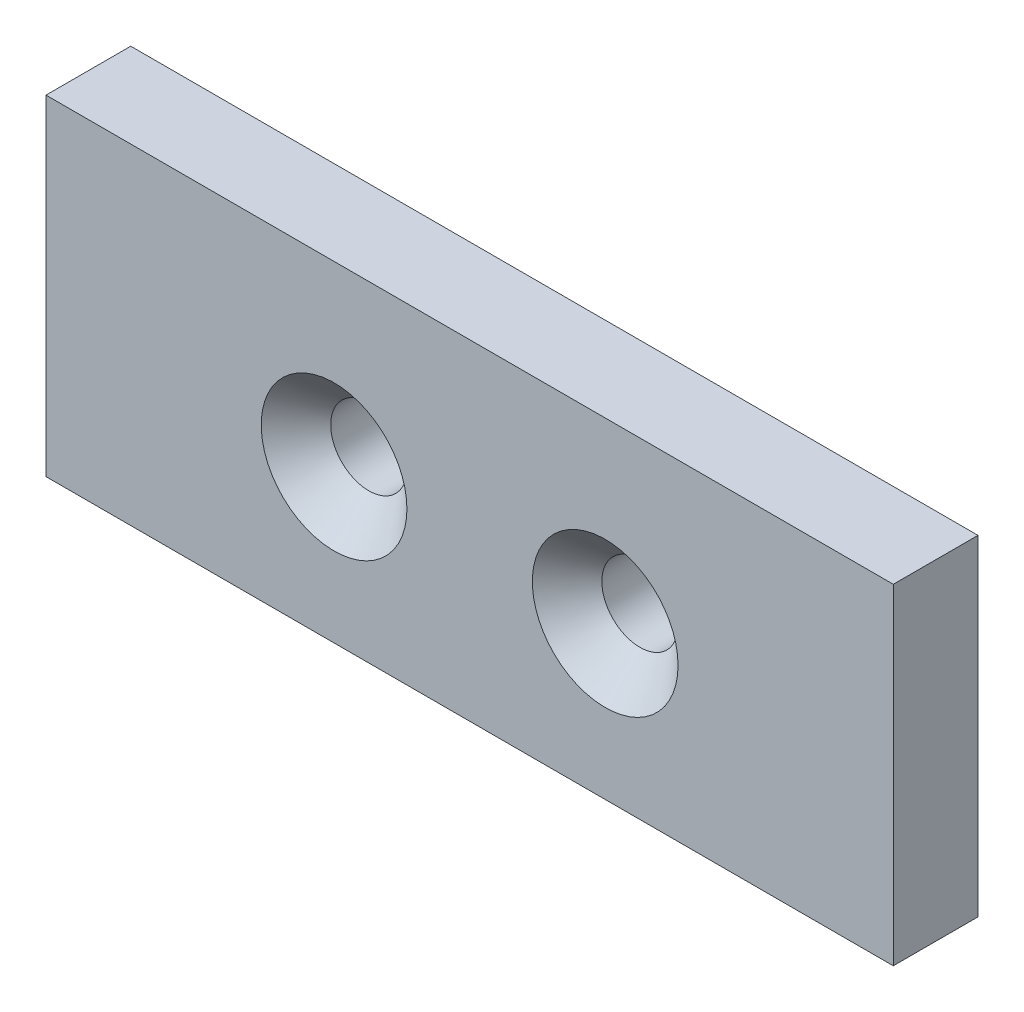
ISO-10303-21;
HEADER;
FILE_DESCRIPTION(('STEP AP214'),'2;1');
FILE_NAME('part.step','',(''),(''),'','','');
FILE_SCHEMA(('AUTOMOTIVE_DESIGN { 1 0 10303 214 1 1 1 1 }'));
ENDSEC;
DATA;
#1=APPLICATION_CONTEXT('core data for automotive mechanical design processes');
#2=APPLICATION_PROTOCOL_DEFINITION('international standard','automotive_design',2000,#1);
#3=PRODUCT_CONTEXT('',#1,'mechanical');
#4=PRODUCT('Part','Part','',(#3));
#5=PRODUCT_RELATED_PRODUCT_CATEGORY('part','',(#4));
#6=PRODUCT_DEFINITION_FORMATION('','',#4);
#7=PRODUCT_DEFINITION_CONTEXT('part definition',#1,'design');
#8=PRODUCT_DEFINITION('design','',#6,#7);
#9=PRODUCT_DEFINITION_SHAPE('','',#8);
#10=(LENGTH_UNIT() NAMED_UNIT(*) SI_UNIT(.MILLI.,.METRE.));
#11=(NAMED_UNIT(*) PLANE_ANGLE_UNIT() SI_UNIT($,.RADIAN.));
#12=(NAMED_UNIT(*) SI_UNIT($,.STERADIAN.) SOLID_ANGLE_UNIT());
#13=UNCERTAINTY_MEASURE_WITH_UNIT(LENGTH_MEASURE(1.E-05),#10,'distance_accuracy_value','');
#14=(GEOMETRIC_REPRESENTATION_CONTEXT(3) GLOBAL_UNCERTAINTY_ASSIGNED_CONTEXT((#13)) GLOBAL_UNIT_ASSIGNED_CONTEXT((#10,
#11,#12)) REPRESENTATION_CONTEXT('',''));
#15=CARTESIAN_POINT('',(0.,0.,0.));
#16=DIRECTION('',(0.,0.,1.));
#17=DIRECTION('',(1.,0.,0.));
#18=AXIS2_PLACEMENT_3D('',#15,#16,#17);
#19=CARTESIAN_POINT('',(50.,-3.763058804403,5.));
#20=DIRECTION('',(-1.,0.,0.));
#21=DIRECTION('',(0.,0.,1.));
#22=AXIS2_PLACEMENT_3D('',#19,#20,#21);
#23=PLANE('',#22);
#24=DIRECTION('',(0.,1.,0.));
#25=VECTOR('',#24,1.);
#26=CARTESIAN_POINT('',(50.,-3.763058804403,0.));
#27=LINE('',#26,#25);
#28=CARTESIAN_POINT('',(50.,-3.763058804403,0.));
#29=VERTEX_POINT('',#28);
#30=CARTESIAN_POINT('',(50.,15.736941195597,0.));
#31=VERTEX_POINT('',#30);
#32=EDGE_CURVE('E79',#29,#31,#27,.T.);
#33=ORIENTED_EDGE('',*,*,#32,.T.);
#34=DIRECTION('',(0.,0.,-1.));
#35=VECTOR('',#34,1.);
#36=CARTESIAN_POINT('',(50.,15.736941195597,5.));
#37=LINE('',#36,#35);
#38=CARTESIAN_POINT('',(50.,15.736941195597,5.));
#39=VERTEX_POINT('',#38);
#40=EDGE_CURVE('E11',#39,#31,#37,.T.);
#41=ORIENTED_EDGE('',*,*,#40,.F.);
#42=DIRECTION('',(0.,1.,0.));
#43=VECTOR('',#42,1.);
#44=CARTESIAN_POINT('',(50.,-3.763058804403,5.));
#45=LINE('',#44,#43);
#46=CARTESIAN_POINT('',(50.,-3.763058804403,5.));
#47=VERTEX_POINT('',#46);
#48=EDGE_CURVE('E67',#47,#39,#45,.T.);
#49=ORIENTED_EDGE('',*,*,#48,.F.);
#50=DIRECTION('',(0.,0.,-1.));
#51=VECTOR('',#50,1.);
#52=CARTESIAN_POINT('',(50.,-3.763058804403,5.));
#53=LINE('',#52,#51);
#54=EDGE_CURVE('E75',#47,#29,#53,.T.);
#55=ORIENTED_EDGE('',*,*,#54,.T.);
#56=EDGE_LOOP('',(#33,#41,#49,#55));
#57=FACE_BOUND('',#56,.T.);
#58=ADVANCED_FACE('F16',(#57),#23,.F.);
#59=CARTESIAN_POINT('',(50.,15.736941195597,5.));
#60=DIRECTION('',(0.,-1.,0.));
#61=DIRECTION('',(0.,0.,-1.));
#62=AXIS2_PLACEMENT_3D('',#59,#60,#61);
#63=PLANE('',#62);
#64=DIRECTION('',(-1.,0.,0.));
#65=VECTOR('',#64,1.);
#66=CARTESIAN_POINT('',(50.,15.736941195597,0.));
#67=LINE('',#66,#65);
#68=CARTESIAN_POINT('',(0.,15.736941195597,0.));
#69=VERTEX_POINT('',#68);
#70=EDGE_CURVE('E71',#31,#69,#67,.T.);
#71=ORIENTED_EDGE('',*,*,#70,.T.);
#72=DIRECTION('',(0.,0.,-1.));
#73=VECTOR('',#72,1.);
#74=CARTESIAN_POINT('',(0.,15.736941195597,5.));
#75=LINE('',#74,#73);
#76=CARTESIAN_POINT('',(0.,15.736941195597,5.));
#77=VERTEX_POINT('',#76);
#78=EDGE_CURVE('E24',#77,#69,#75,.T.);
#79=ORIENTED_EDGE('',*,*,#78,.F.);
#80=DIRECTION('',(-1.,0.,0.));
#81=VECTOR('',#80,1.);
#82=CARTESIAN_POINT('',(50.,15.736941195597,5.));
#83=LINE('',#82,#81);
#84=EDGE_CURVE('E62',#39,#77,#83,.T.);
#85=ORIENTED_EDGE('',*,*,#84,.F.);
#86=ORIENTED_EDGE('',*,*,#40,.T.);
#87=EDGE_LOOP('',(#71,#79,#85,#86));
#88=FACE_BOUND('',#87,.T.);
#89=ADVANCED_FACE('F70',(#88),#63,.F.);
#90=CARTESIAN_POINT('',(0.,-3.763058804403,5.));
#91=DIRECTION('',(1.,0.,0.));
#92=DIRECTION('',(0.,0.,-1.));
#93=AXIS2_PLACEMENT_3D('',#90,#91,#92);
#94=PLANE('',#93);
#95=DIRECTION('',(0.,-1.,0.));
#96=VECTOR('',#95,1.);
#97=CARTESIAN_POINT('',(0.,-3.763058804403,0.));
#98=LINE('',#97,#96);
#99=CARTESIAN_POINT('',(0.,-3.763058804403,0.));
#100=VERTEX_POINT('',#99);
#101=EDGE_CURVE('E49',#69,#100,#98,.T.);
#102=ORIENTED_EDGE('',*,*,#101,.T.);
#103=DIRECTION('',(0.,0.,-1.));
#104=VECTOR('',#103,1.);
#105=CARTESIAN_POINT('',(0.,-3.763058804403,5.));
#106=LINE('',#105,#104);
#107=CARTESIAN_POINT('',(0.,-3.763058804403,5.));
#108=VERTEX_POINT('',#107);
#109=EDGE_CURVE('E72',#108,#100,#106,.T.);
#110=ORIENTED_EDGE('',*,*,#109,.F.);
#111=DIRECTION('',(0.,-1.,0.));
#112=VECTOR('',#111,1.);
#113=CARTESIAN_POINT('',(0.,-3.763058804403,5.));
#114=LINE('',#113,#112);
#115=EDGE_CURVE('E65',#77,#108,#114,.T.);
#116=ORIENTED_EDGE('',*,*,#115,.F.);
#117=ORIENTED_EDGE('',*,*,#78,.T.);
#118=EDGE_LOOP('',(#102,#110,#116,#117));
#119=FACE_BOUND('',#118,.T.);
#120=ADVANCED_FACE('F73',(#119),#94,.F.);
#121=CARTESIAN_POINT('',(50.,-3.763058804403,5.));
#122=DIRECTION('',(0.,1.,0.));
#123=DIRECTION('',(0.,0.,1.));
#124=AXIS2_PLACEMENT_3D('',#121,#122,#123);
#125=PLANE('',#124);
#126=DIRECTION('',(1.,0.,0.));
#127=VECTOR('',#126,1.);
#128=CARTESIAN_POINT('',(50.,-3.763058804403,0.));
#129=LINE('',#128,#127);
#130=EDGE_CURVE('E55',#100,#29,#129,.T.);
#131=ORIENTED_EDGE('',*,*,#130,.T.);
#132=ORIENTED_EDGE('',*,*,#54,.F.);
#133=DIRECTION('',(1.,0.,0.));
#134=VECTOR('',#133,1.);
#135=CARTESIAN_POINT('',(50.,-3.763058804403,5.));
#136=LINE('',#135,#134);
#137=EDGE_CURVE('E32',#108,#47,#136,.T.);
#138=ORIENTED_EDGE('',*,*,#137,.F.);
#139=ORIENTED_EDGE('',*,*,#109,.T.);
#140=EDGE_LOOP('',(#131,#132,#138,#139));
#141=FACE_BOUND('',#140,.T.);
#142=ADVANCED_FACE('F87',(#141),#125,.F.);
#143=CARTESIAN_POINT('',(0.,0.,5.));
#144=DIRECTION('',(0.,0.,1.));
#145=DIRECTION('',(1.,0.,0.));
#146=AXIS2_PLACEMENT_3D('',#143,#144,#145);
#147=PLANE('',#146);
#148=CARTESIAN_POINT('',(17.,5.23694119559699,5.));
#149=DIRECTION('',(0.,0.,1.));
#150=DIRECTION('',(1.,0.,0.));
#151=AXIS2_PLACEMENT_3D('',#148,#149,#150);
#152=CIRCLE('',#151,4.3);
#153=CARTESIAN_POINT('',(21.3,5.23694119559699,5.));
#154=VERTEX_POINT('',#153);
#155=EDGE_CURVE('E107',#154,#154,#152,.T.);
#156=ORIENTED_EDGE('',*,*,#155,.F.);
#157=EDGE_LOOP('',(#156));
#158=FACE_BOUND('',#157,.T.);
#159=CARTESIAN_POINT('',(33.,5.23694119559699,5.));
#160=DIRECTION('',(0.,0.,1.));
#161=DIRECTION('',(1.,0.,0.));
#162=AXIS2_PLACEMENT_3D('',#159,#160,#161);
#163=CIRCLE('',#162,4.3);
#164=CARTESIAN_POINT('',(37.3,5.23694119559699,5.));
#165=VERTEX_POINT('',#164);
#166=EDGE_CURVE('E98',#165,#165,#163,.T.);
#167=ORIENTED_EDGE('',*,*,#166,.F.);
#168=EDGE_LOOP('',(#167));
#169=FACE_BOUND('',#168,.T.);
#170=ORIENTED_EDGE('',*,*,#48,.T.);
#171=ORIENTED_EDGE('',*,*,#84,.T.);
#172=ORIENTED_EDGE('',*,*,#115,.T.);
#173=ORIENTED_EDGE('',*,*,#137,.T.);
#174=EDGE_LOOP('',(#170,#171,#172,#173));
#175=FACE_BOUND('',#174,.T.);
#176=ADVANCED_FACE('F63',(#158,#169,#175),#147,.T.);
#177=CARTESIAN_POINT('',(0.,0.,0.));
#178=DIRECTION('',(0.,0.,1.));
#179=DIRECTION('',(1.,0.,0.));
#180=AXIS2_PLACEMENT_3D('',#177,#178,#179);
#181=PLANE('',#180);
#182=CARTESIAN_POINT('',(17.,5.23694119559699,0.));
#183=DIRECTION('',(0.,0.,1.));
#184=DIRECTION('',(1.,0.,0.));
#185=AXIS2_PLACEMENT_3D('',#182,#183,#184);
#186=CIRCLE('',#185,2.25);
#187=CARTESIAN_POINT('',(19.25,5.23694119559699,0.));
#188=VERTEX_POINT('',#187);
#189=EDGE_CURVE('E101',#188,#188,#186,.T.);
#190=ORIENTED_EDGE('',*,*,#189,.T.);
#191=EDGE_LOOP('',(#190));
#192=FACE_BOUND('',#191,.T.);
#193=CARTESIAN_POINT('',(33.,5.23694119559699,0.));
#194=DIRECTION('',(0.,0.,1.));
#195=DIRECTION('',(1.,0.,0.));
#196=AXIS2_PLACEMENT_3D('',#193,#194,#195);
#197=CIRCLE('',#196,2.25);
#198=CARTESIAN_POINT('',(35.25,5.23694119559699,0.));
#199=VERTEX_POINT('',#198);
#200=EDGE_CURVE('E82',#199,#199,#197,.T.);
#201=ORIENTED_EDGE('',*,*,#200,.T.);
#202=EDGE_LOOP('',(#201));
#203=FACE_BOUND('',#202,.T.);
#204=ORIENTED_EDGE('',*,*,#32,.F.);
#205=ORIENTED_EDGE('',*,*,#130,.F.);
#206=ORIENTED_EDGE('',*,*,#101,.F.);
#207=ORIENTED_EDGE('',*,*,#70,.F.);
#208=EDGE_LOOP('',(#204,#205,#206,#207));
#209=FACE_BOUND('',#208,.T.);
#210=ADVANCED_FACE('F90',(#192,#203,#209),#181,.F.);
#211=CARTESIAN_POINT('',(33.,5.23694119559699,5.));
#212=DIRECTION('',(0.,0.,1.));
#213=DIRECTION('',(1.,0.,0.));
#214=AXIS2_PLACEMENT_3D('',#211,#212,#213);
#215=CYLINDRICAL_SURFACE('',#214,2.25);
#216=ORIENTED_EDGE('',*,*,#200,.F.);
#217=EDGE_LOOP('',(#216));
#218=FACE_BOUND('',#217,.T.);
#219=CARTESIAN_POINT('',(33.,5.23694119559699,2.95));
#220=DIRECTION('',(0.,0.,1.));
#221=DIRECTION('',(1.,0.,0.));
#222=AXIS2_PLACEMENT_3D('',#219,#220,#221);
#223=CIRCLE('',#222,2.25);
#224=CARTESIAN_POINT('',(35.25,5.23694119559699,2.95));
#225=VERTEX_POINT('',#224);
#226=EDGE_CURVE('E95',#225,#225,#223,.T.);
#227=ORIENTED_EDGE('',*,*,#226,.T.);
#228=EDGE_LOOP('',(#227));
#229=FACE_BOUND('',#228,.T.);
#230=ADVANCED_FACE('F121',(#218,#229),#215,.F.);
#231=CARTESIAN_POINT('',(33.,5.23694119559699,5.));
#232=DIRECTION('',(0.,0.,1.));
#233=DIRECTION('',(1.,0.,0.));
#234=AXIS2_PLACEMENT_3D('',#231,#232,#233);
#235=CONICAL_SURFACE('',#234,4.3,0.785398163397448);
#236=ORIENTED_EDGE('',*,*,#226,.F.);
#237=EDGE_LOOP('',(#236));
#238=FACE_BOUND('',#237,.T.);
#239=ORIENTED_EDGE('',*,*,#166,.T.);
#240=EDGE_LOOP('',(#239));
#241=FACE_BOUND('',#240,.T.);
#242=ADVANCED_FACE('F118',(#238,#241),#235,.F.);
#243=CARTESIAN_POINT('',(17.,5.23694119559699,5.));
#244=DIRECTION('',(0.,0.,1.));
#245=DIRECTION('',(1.,0.,0.));
#246=AXIS2_PLACEMENT_3D('',#243,#244,#245);
#247=CYLINDRICAL_SURFACE('',#246,2.25);
#248=ORIENTED_EDGE('',*,*,#189,.F.);
#249=EDGE_LOOP('',(#248));
#250=FACE_BOUND('',#249,.T.);
#251=CARTESIAN_POINT('',(17.,5.23694119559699,2.95));
#252=DIRECTION('',(0.,0.,1.));
#253=DIRECTION('',(1.,0.,0.));
#254=AXIS2_PLACEMENT_3D('',#251,#252,#253);
#255=CIRCLE('',#254,2.25);
#256=CARTESIAN_POINT('',(19.25,5.23694119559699,2.95));
#257=VERTEX_POINT('',#256);
#258=EDGE_CURVE('E104',#257,#257,#255,.T.);
#259=ORIENTED_EDGE('',*,*,#258,.T.);
#260=EDGE_LOOP('',(#259));
#261=FACE_BOUND('',#260,.T.);
#262=ADVANCED_FACE('F120',(#250,#261),#247,.F.);
#263=CARTESIAN_POINT('',(17.,5.23694119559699,5.));
#264=DIRECTION('',(0.,0.,1.));
#265=DIRECTION('',(1.,0.,0.));
#266=AXIS2_PLACEMENT_3D('',#263,#264,#265);
#267=CONICAL_SURFACE('',#266,4.3,0.785398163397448);
#268=ORIENTED_EDGE('',*,*,#258,.F.);
#269=EDGE_LOOP('',(#268));
#270=FACE_BOUND('',#269,.T.);
#271=ORIENTED_EDGE('',*,*,#155,.T.);
#272=EDGE_LOOP('',(#271));
#273=FACE_BOUND('',#272,.T.);
#274=ADVANCED_FACE('F111',(#270,#273),#267,.F.);
#275=CLOSED_SHELL('',(#58,#89,#120,#142,#176,#210,#230,#242,#262,#274));
#276=MANIFOLD_SOLID_BREP('B1',#275);
#277=ADVANCED_BREP_SHAPE_REPRESENTATION('',(#18,#276),#14);
#278=SHAPE_DEFINITION_REPRESENTATION(#9,#277);
ENDSEC;
END-ISO-10303-21;
